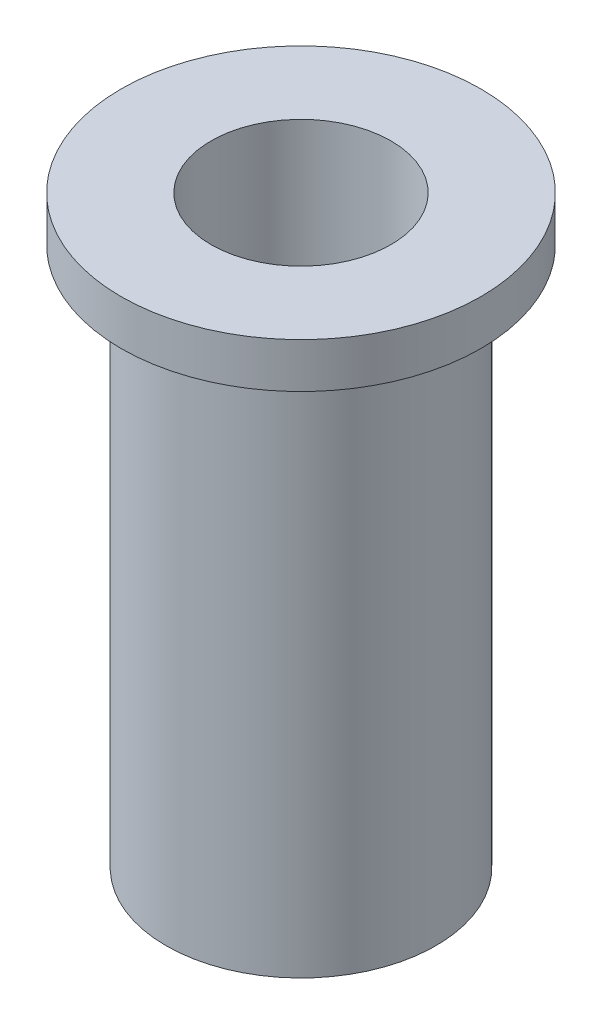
from build123d import *

# Parameters (mm, degrees)
SKETCH1_R           = 6.35
SKETCH1_R_2         = 3.175
BOSS_EXTRUDE1_DEPTH = 20.6375
SKETCH2_OUTSIDE_W   = 20.172
SKETCH2_OUTSIDE_H   = 20.172
SKETCH2_OUTSIDE_R   = 4.7625
CUT_EXTRUDE1_DEPTH  = 19.05


with BuildPart() as part:
    # Sketch1 → Boss-Extrude1 (new body)
    with BuildSketch(Plane(origin=(0, 0, 0), x_dir=(1, 0, 0), z_dir=(0, 1, 0))):
        with Locations(Location((0, 0, 0), (0, 0, 270))):
            Circle(SKETCH1_R)
        with Locations(Location((0, 0, 0), (0, 0, 270))):
            Circle(SKETCH1_R_2, mode=Mode.SUBTRACT)
    extrude(amount=-BOSS_EXTRUDE1_DEPTH)

    # Sketch2 outside → Cut-Extrude1 (cut)
    with BuildSketch(Plane.XZ.offset(20.6375)):
        Rectangle(SKETCH2_OUTSIDE_W, SKETCH2_OUTSIDE_H)
        with Locations(Location((0, 0, 0), (0, 0, 270))):
            Circle(SKETCH2_OUTSIDE_R, mode=Mode.SUBTRACT)
    extrude(amount=-CUT_EXTRUDE1_DEPTH, mode=Mode.SUBTRACT)


solid = part.part
